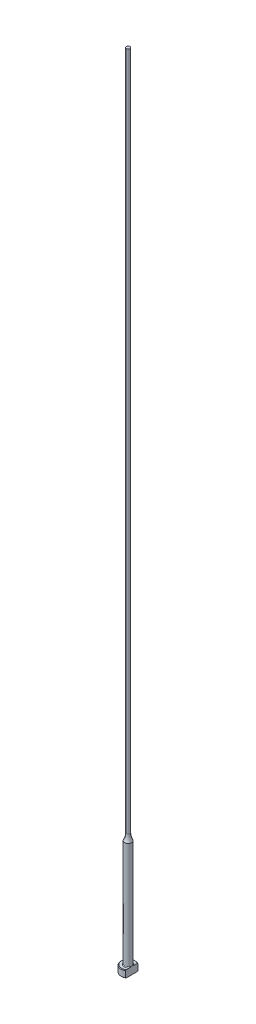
ISO-10303-21;
HEADER;
FILE_DESCRIPTION(('STEP AP214'),'2;1');
FILE_NAME('part.step','',(''),(''),'','','');
FILE_SCHEMA(('AUTOMOTIVE_DESIGN { 1 0 10303 214 1 1 1 1 }'));
ENDSEC;
DATA;
#1=APPLICATION_CONTEXT('core data for automotive mechanical design processes');
#2=APPLICATION_PROTOCOL_DEFINITION('international standard','automotive_design',2000,#1);
#3=PRODUCT_CONTEXT('',#1,'mechanical');
#4=PRODUCT('Part','Part','',(#3));
#5=PRODUCT_RELATED_PRODUCT_CATEGORY('part','',(#4));
#6=PRODUCT_DEFINITION_FORMATION('','',#4);
#7=PRODUCT_DEFINITION_CONTEXT('part definition',#1,'design');
#8=PRODUCT_DEFINITION('design','',#6,#7);
#9=PRODUCT_DEFINITION_SHAPE('','',#8);
#10=(LENGTH_UNIT() NAMED_UNIT(*) SI_UNIT(.MILLI.,.METRE.));
#11=(NAMED_UNIT(*) PLANE_ANGLE_UNIT() SI_UNIT($,.RADIAN.));
#12=(NAMED_UNIT(*) SI_UNIT($,.STERADIAN.) SOLID_ANGLE_UNIT());
#13=UNCERTAINTY_MEASURE_WITH_UNIT(LENGTH_MEASURE(1.E-05),#10,'distance_accuracy_value','');
#14=(GEOMETRIC_REPRESENTATION_CONTEXT(3) GLOBAL_UNCERTAINTY_ASSIGNED_CONTEXT((#13)) GLOBAL_UNIT_ASSIGNED_CONTEXT((#10,
#11,#12)) REPRESENTATION_CONTEXT('',''));
#15=CARTESIAN_POINT('',(0.,0.,0.));
#16=DIRECTION('',(0.,0.,1.));
#17=DIRECTION('',(1.,0.,0.));
#18=AXIS2_PLACEMENT_3D('',#15,#16,#17);
#19=CARTESIAN_POINT('',(-3.17499999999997,3.175,0.));
#20=DIRECTION('',(0.,1.,0.));
#21=DIRECTION('',(0.,0.,1.));
#22=AXIS2_PLACEMENT_3D('',#19,#20,#21);
#23=PLANE('',#22);
#24=CARTESIAN_POINT('',(0.,3.175,0.));
#25=DIRECTION('',(0.,1.,0.));
#26=DIRECTION('',(0.,0.,1.));
#27=AXIS2_PLACEMENT_3D('',#24,#25,#26);
#28=CIRCLE('',#27,2.92099999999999);
#29=CARTESIAN_POINT('',(1.58749999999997,3.175,-2.4519552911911));
#30=VERTEX_POINT('',#29);
#31=CARTESIAN_POINT('',(1.58749999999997,3.175,2.4519552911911));
#32=VERTEX_POINT('',#31);
#33=EDGE_CURVE('E105',#30,#32,#28,.T.);
#34=ORIENTED_EDGE('',*,*,#33,.T.);
#35=DIRECTION('',(0.,0.,1.));
#36=VECTOR('',#35,1.);
#37=CARTESIAN_POINT('',(1.58749999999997,3.17499999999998,2.74963065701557));
#38=LINE('',#37,#36);
#39=CARTESIAN_POINT('',(1.58749999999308,3.175,0.933255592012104));
#40=VERTEX_POINT('',#39);
#41=EDGE_CURVE('E126',#40,#32,#38,.T.);
#42=ORIENTED_EDGE('',*,*,#41,.F.);
#43=CARTESIAN_POINT('',(0.,3.175,0.));
#44=DIRECTION('',(0.,1.,0.));
#45=DIRECTION('',(0.,0.,1.));
#46=AXIS2_PLACEMENT_3D('',#43,#44,#45);
#47=CIRCLE('',#46,1.84149999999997);
#48=CARTESIAN_POINT('',(1.58749999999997,3.17500000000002,-0.933255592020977));
#49=VERTEX_POINT('',#48);
#50=EDGE_CURVE('E11',#40,#49,#47,.F.);
#51=ORIENTED_EDGE('',*,*,#50,.T.);
#52=EDGE_CURVE('E52',#30,#49,#38,.T.);
#53=ORIENTED_EDGE('',*,*,#52,.F.);
#54=EDGE_LOOP('',(#34,#42,#51,#53));
#55=FACE_BOUND('',#54,.T.);
#56=ADVANCED_FACE('F32',(#55),#23,.T.);
#57=CARTESIAN_POINT('',(0.,259.958771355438,0.));
#58=DIRECTION('',(0.,1.,0.));
#59=DIRECTION('',(0.,0.,1.));
#60=AXIS2_PLACEMENT_3D('',#57,#58,#59);
#61=CYLINDRICAL_SURFACE('',#60,3.17499999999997);
#62=CARTESIAN_POINT('',(0.,2.92100000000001,0.));
#63=DIRECTION('',(0.,1.,0.));
#64=DIRECTION('',(0.,0.,1.));
#65=AXIS2_PLACEMENT_3D('',#62,#63,#64);
#66=CIRCLE('',#65,3.17499999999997);
#67=CARTESIAN_POINT('',(1.58749999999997,2.92100000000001,2.74963065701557));
#68=VERTEX_POINT('',#67);
#69=CARTESIAN_POINT('',(1.58749999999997,2.92100000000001,-2.74963065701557));
#70=VERTEX_POINT('',#69);
#71=EDGE_CURVE('E98',#68,#70,#66,.F.);
#72=ORIENTED_EDGE('',*,*,#71,.T.);
#73=DIRECTION('',(0.,-1.,0.));
#74=VECTOR('',#73,1.);
#75=CARTESIAN_POINT('',(1.58749999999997,355.601,-2.74963065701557));
#76=LINE('',#75,#74);
#77=CARTESIAN_POINT('',(1.58749999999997,0.253999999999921,-2.74963065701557));
#78=VERTEX_POINT('',#77);
#79=EDGE_CURVE('E141',#70,#78,#76,.T.);
#80=ORIENTED_EDGE('',*,*,#79,.T.);
#81=CARTESIAN_POINT('',(0.,0.253999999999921,0.));
#82=DIRECTION('',(0.,-1.,0.));
#83=DIRECTION('',(0.,0.,-1.));
#84=AXIS2_PLACEMENT_3D('',#81,#82,#83);
#85=CIRCLE('',#84,3.17499999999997);
#86=CARTESIAN_POINT('',(1.58749999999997,0.253999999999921,2.74963065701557));
#87=VERTEX_POINT('',#86);
#88=EDGE_CURVE('E95',#78,#87,#85,.F.);
#89=ORIENTED_EDGE('',*,*,#88,.T.);
#90=DIRECTION('',(0.,-1.,0.));
#91=VECTOR('',#90,1.);
#92=CARTESIAN_POINT('',(1.58749999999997,355.601,2.74963065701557));
#93=LINE('',#92,#91);
#94=EDGE_CURVE('E88',#68,#87,#93,.T.);
#95=ORIENTED_EDGE('',*,*,#94,.F.);
#96=EDGE_LOOP('',(#72,#80,#89,#95));
#97=FACE_BOUND('',#96,.T.);
#98=ADVANCED_FACE('F191',(#97),#61,.T.);
#99=CARTESIAN_POINT('',(0.,0.,0.));
#100=DIRECTION('',(0.,-1.,0.));
#101=DIRECTION('',(0.,0.,-1.));
#102=AXIS2_PLACEMENT_3D('',#99,#100,#101);
#103=PLANE('',#102);
#104=CARTESIAN_POINT('',(0.,0.,0.));
#105=DIRECTION('',(0.,-1.,0.));
#106=DIRECTION('',(0.,0.,-1.));
#107=AXIS2_PLACEMENT_3D('',#104,#105,#106);
#108=CIRCLE('',#107,2.92100000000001);
#109=CARTESIAN_POINT('',(1.58749999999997,0.,2.45195529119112));
#110=VERTEX_POINT('',#109);
#111=CARTESIAN_POINT('',(1.58749999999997,0.,-2.45195529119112));
#112=VERTEX_POINT('',#111);
#113=EDGE_CURVE('E93',#110,#112,#108,.T.);
#114=ORIENTED_EDGE('',*,*,#113,.T.);
#115=DIRECTION('',(0.,0.,1.));
#116=VECTOR('',#115,1.);
#117=CARTESIAN_POINT('',(1.58749999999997,0.,2.74963065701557));
#118=LINE('',#117,#116);
#119=EDGE_CURVE('E78',#112,#110,#118,.T.);
#120=ORIENTED_EDGE('',*,*,#119,.T.);
#121=EDGE_LOOP('',(#114,#120));
#122=FACE_BOUND('',#121,.T.);
#123=ADVANCED_FACE('F97',(#122),#103,.T.);
#124=CARTESIAN_POINT('',(0.,3.17499999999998,0.));
#125=DIRECTION('',(0.,-1.,0.));
#126=DIRECTION('',(0.,0.,-1.));
#127=AXIS2_PLACEMENT_3D('',#124,#125,#126);
#128=CONICAL_SURFACE('',#127,2.92100000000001,0.785398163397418);
#129=ORIENTED_EDGE('',*,*,#71,.F.);
#130=CARTESIAN_POINT('',(1.58749999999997,-0.161620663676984,-6.0529050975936));
#131=CARTESIAN_POINT('',(1.58749999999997,-0.0288893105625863,-5.91567682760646));
#132=CARTESIAN_POINT('',(1.58749999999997,0.103699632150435,-5.77831035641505));
#133=CARTESIAN_POINT('',(1.58749999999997,0.368508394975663,-5.50321874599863));
#134=CARTESIAN_POINT('',(1.58749999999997,0.5007282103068,-5.3654936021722));
#135=CARTESIAN_POINT('',(1.58749999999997,0.764778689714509,-5.08953516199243));
#136=CARTESIAN_POINT('',(1.58749999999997,0.896609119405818,-4.95130164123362));
#137=CARTESIAN_POINT('',(1.58749999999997,1.15968706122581,-4.67428233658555));
#138=CARTESIAN_POINT('',(1.58749999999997,1.29093457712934,-4.5354965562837));
#139=CARTESIAN_POINT('',(1.58749999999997,1.55007705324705,-4.25997724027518));
#140=CARTESIAN_POINT('',(1.58749999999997,1.67798684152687,-4.12325766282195));
#141=CARTESIAN_POINT('',(1.58749999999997,1.9328486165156,-3.84892898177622));
#142=CARTESIAN_POINT('',(1.58749999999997,2.05980060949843,-3.71131988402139));
#143=CARTESIAN_POINT('',(1.58749999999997,2.31237508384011,-3.43493978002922));
#144=CARTESIAN_POINT('',(1.58749999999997,2.43799784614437,-3.29616903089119));
#145=CARTESIAN_POINT('',(1.58749999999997,2.68741369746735,-3.01699558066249));
#146=CARTESIAN_POINT('',(1.58749999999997,2.81120686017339,-2.8765929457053));
#147=CARTESIAN_POINT('',(1.58749999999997,3.00875865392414,-2.64816703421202));
#148=CARTESIAN_POINT('',(1.58749999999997,3.08336151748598,-2.56087478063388));
#149=CARTESIAN_POINT('',(1.58749999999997,3.23123871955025,-2.385154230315));
#150=CARTESIAN_POINT('',(1.58749999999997,3.30451292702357,-2.29672582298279));
#151=CARTESIAN_POINT('',(1.58749999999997,3.45004422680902,-2.11747400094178));
#152=CARTESIAN_POINT('',(1.58749999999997,3.52228237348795,-2.02663514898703));
#153=CARTESIAN_POINT('',(1.58749999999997,3.66423097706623,-1.84302524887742));
#154=CARTESIAN_POINT('',(1.58749999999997,3.73394203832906,-1.75025467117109));
#155=CARTESIAN_POINT('',(1.58749999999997,3.87080633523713,-1.56067475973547));
#156=CARTESIAN_POINT('',(1.58749999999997,3.93790459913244,-1.46382547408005));
#157=CARTESIAN_POINT('',(1.58749999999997,4.06669147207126,-1.26632594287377));
#158=CARTESIAN_POINT('',(1.58749999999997,4.12837264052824,-1.16567073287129));
#159=CARTESIAN_POINT('',(1.58749999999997,4.21402252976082,-1.01165766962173));
#160=CARTESIAN_POINT('',(1.58749999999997,4.2412792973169,-0.960142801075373));
#161=CARTESIAN_POINT('',(1.58749999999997,4.29309798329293,-0.85578092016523));
#162=CARTESIAN_POINT('',(1.58749999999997,4.3176594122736,-0.802933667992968));
#163=CARTESIAN_POINT('',(1.58749999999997,4.38614656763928,-0.642461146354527));
#164=CARTESIAN_POINT('',(1.58749999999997,4.42510149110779,-0.532518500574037));
#165=CARTESIAN_POINT('',(1.58749999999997,4.46726244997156,-0.367680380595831));
#166=CARTESIAN_POINT('',(1.58749999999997,4.47844427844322,-0.314802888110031));
#167=CARTESIAN_POINT('',(1.58749999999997,4.49576654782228,-0.208209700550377));
#168=CARTESIAN_POINT('',(1.58749999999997,4.50190743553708,-0.154494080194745));
#169=CARTESIAN_POINT('',(1.58749999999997,4.50871296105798,-0.0468792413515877));
#170=CARTESIAN_POINT('',(1.58749999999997,4.50939451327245,0.00701889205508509));
#171=CARTESIAN_POINT('',(1.58749999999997,4.5052767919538,0.114606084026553));
#172=CARTESIAN_POINT('',(1.58749999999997,4.5004770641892,0.16829512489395));
#173=CARTESIAN_POINT('',(1.58749999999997,4.48579689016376,0.274485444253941));
#174=CARTESIAN_POINT('',(1.58749999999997,4.47596081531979,0.326992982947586));
#175=CARTESIAN_POINT('',(1.58749999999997,4.4518180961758,0.430974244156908));
#176=CARTESIAN_POINT('',(1.58749999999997,4.43750969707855,0.482447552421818));
#177=CARTESIAN_POINT('',(1.58749999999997,4.40502489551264,0.58446088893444));
#178=CARTESIAN_POINT('',(1.58749999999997,4.38682724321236,0.634994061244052));
#179=CARTESIAN_POINT('',(1.58749999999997,4.34729308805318,0.734789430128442));
#180=CARTESIAN_POINT('',(1.58749999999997,4.32595722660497,0.784051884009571));
#181=CARTESIAN_POINT('',(1.58749999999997,4.25791922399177,0.93054934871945));
#182=CARTESIAN_POINT('',(1.58749999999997,4.20736047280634,1.02598802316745));
#183=CARTESIAN_POINT('',(1.58749999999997,4.09955451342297,1.21304313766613));
#184=CARTESIAN_POINT('',(1.58749999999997,4.04229912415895,1.30465471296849));
#185=CARTESIAN_POINT('',(1.58749999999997,3.92308746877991,1.48526211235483));
#186=CARTESIAN_POINT('',(1.58749999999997,3.86111349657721,1.57424615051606));
#187=CARTESIAN_POINT('',(1.58749999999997,3.73408621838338,1.74990003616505));
#188=CARTESIAN_POINT('',(1.58749999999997,3.66903444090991,1.83657099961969));
#189=CARTESIAN_POINT('',(1.58749999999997,3.53583371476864,2.009317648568));
#190=CARTESIAN_POINT('',(1.58749999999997,3.46765527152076,2.09537048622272));
#191=CARTESIAN_POINT('',(1.58749999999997,3.32960643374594,2.26611736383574));
#192=CARTESIAN_POINT('',(1.58749999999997,3.25973586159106,2.35081125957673));
#193=CARTESIAN_POINT('',(1.58749999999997,3.04858139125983,2.60290121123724));
#194=CARTESIAN_POINT('',(1.58749999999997,2.90542388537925,2.7687253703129));
#195=CARTESIAN_POINT('',(1.58749999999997,2.64069522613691,3.06970913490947));
#196=CARTESIAN_POINT('',(1.58749999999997,2.5195945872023,3.20528660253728));
#197=CARTESIAN_POINT('',(1.58749999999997,2.27590400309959,3.47510321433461));
#198=CARTESIAN_POINT('',(1.58749999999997,2.1533140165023,3.60934232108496));
#199=CARTESIAN_POINT('',(1.58749999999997,1.9069423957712,3.87695374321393));
#200=CARTESIAN_POINT('',(1.58749999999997,1.78315974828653,4.01032512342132));
#201=CARTESIAN_POINT('',(1.58749999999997,1.53478104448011,4.2763088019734));
#202=CARTESIAN_POINT('',(1.58749999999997,1.41018498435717,4.40892109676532));
#203=CARTESIAN_POINT('',(1.58749999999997,1.04574684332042,4.79499418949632));
#204=CARTESIAN_POINT('',(1.58749999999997,0.805076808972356,5.04767313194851));
#205=CARTESIAN_POINT('',(1.58749999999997,0.44312150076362,5.42550911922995));
#206=CARTESIAN_POINT('',(1.58749999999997,0.322378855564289,5.55118772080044));
#207=CARTESIAN_POINT('',(1.58749999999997,0.0805914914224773,5.8022520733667));
#208=CARTESIAN_POINT('',(1.58749999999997,-0.0404532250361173,5.92763782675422));
#209=CARTESIAN_POINT('',(1.58749999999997,-0.161620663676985,6.0529050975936));
#210=B_SPLINE_CURVE_WITH_KNOTS('',3,(#130,#131,#132,#133,#134,#135,#136,#137,#138,#139,#140,
#141,#142,#143,#144,#145,#146,#147,#148,#149,#150,#151,#152,#153,#154,#155,#156,#157,#158,#159,
#160,#161,#162,#163,#164,#165,#166,#167,#168,#169,#170,#171,#172,#173,#174,#175,#176,#177,#178,
#179,#180,#181,#182,#183,#184,#185,#186,#187,#188,#189,#190,#191,#192,#193,#194,#195,#196,#197,
#198,#199,#200,#201,#202,#203,#204,#205,#206,#207,#208,#209),.UNSPECIFIED.,.F.,.F.,(4,2,2,2,2,2,
2,2,2,2,2,2,2,2,2,2,2,2,2,2,2,2,2,2,2,2,2,2,2,2,2,2,2,2,2,2,2,2,2,4),(0.,0.572750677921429,
1.14550874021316,1.71856057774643,2.29160869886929,2.85328006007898,3.41494773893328,
3.97649423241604,4.53801804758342,4.88249307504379,5.2270018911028,5.57515326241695,
5.92322081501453,6.27657800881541,6.63041319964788,6.80518126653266,6.97998101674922,
7.32824262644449,7.49018491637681,7.65211285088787,7.81353889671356,7.97497832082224,
8.13501929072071,8.29512313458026,8.45612518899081,8.61709438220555,8.94062993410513,
9.26456495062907,9.58978187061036,9.91483894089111,10.2441741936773,10.5735441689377,
11.2306812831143,11.7760337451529,12.3214014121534,12.8672825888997,13.4131663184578,
14.4600164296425,14.9828595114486,15.505698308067),.UNSPECIFIED.);
#211=EDGE_CURVE('E118',#32,#68,#210,.T.);
#212=ORIENTED_EDGE('',*,*,#211,.F.);
#213=ORIENTED_EDGE('',*,*,#33,.F.);
#214=EDGE_CURVE('E117',#70,#30,#210,.T.);
#215=ORIENTED_EDGE('',*,*,#214,.F.);
#216=EDGE_LOOP('',(#129,#212,#213,#215));
#217=FACE_BOUND('',#216,.T.);
#218=ADVANCED_FACE('F162',(#217),#128,.T.);
#219=CARTESIAN_POINT('',(0.,0.253999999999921,0.));
#220=DIRECTION('',(0.,1.,0.));
#221=DIRECTION('',(0.,0.,1.));
#222=AXIS2_PLACEMENT_3D('',#219,#220,#221);
#223=CONICAL_SURFACE('',#222,3.17499999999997,0.785398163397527);
#224=ORIENTED_EDGE('',*,*,#88,.F.);
#225=CARTESIAN_POINT('',(1.58749999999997,3.33662066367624,6.0529050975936));
#226=CARTESIAN_POINT('',(1.58749999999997,3.20388931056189,5.91567682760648));
#227=CARTESIAN_POINT('',(1.58749999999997,3.07130036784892,5.7783103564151));
#228=CARTESIAN_POINT('',(1.58749999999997,2.80649160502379,5.50321874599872));
#229=CARTESIAN_POINT('',(1.58749999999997,2.6742717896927,5.36549360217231));
#230=CARTESIAN_POINT('',(1.58749999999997,2.41022131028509,5.08953516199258));
#231=CARTESIAN_POINT('',(1.58749999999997,2.27839088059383,4.95130164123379));
#232=CARTESIAN_POINT('',(1.58749999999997,2.01531293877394,4.67428233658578));
#233=CARTESIAN_POINT('',(1.58749999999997,1.88406542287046,4.53549655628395));
#234=CARTESIAN_POINT('',(1.58749999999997,1.62492294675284,4.25997724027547));
#235=CARTESIAN_POINT('',(1.58749999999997,1.49701315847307,4.12325766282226));
#236=CARTESIAN_POINT('',(1.58749999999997,1.24215138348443,3.84892898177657));
#237=CARTESIAN_POINT('',(1.58749999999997,1.11519939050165,3.71131988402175));
#238=CARTESIAN_POINT('',(1.58749999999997,0.862624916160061,3.43493978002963));
#239=CARTESIAN_POINT('',(1.58749999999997,0.737002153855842,3.29616903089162));
#240=CARTESIAN_POINT('',(1.58749999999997,0.487586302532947,3.01699558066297));
#241=CARTESIAN_POINT('',(1.58749999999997,0.363793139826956,2.8765929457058));
#242=CARTESIAN_POINT('',(1.58749999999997,0.166241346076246,2.64816703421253));
#243=CARTESIAN_POINT('',(1.58749999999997,0.0916384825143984,2.56087478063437));
#244=CARTESIAN_POINT('',(1.58749999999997,-0.0562387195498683,2.38515423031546));
#245=CARTESIAN_POINT('',(1.58749999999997,-0.129512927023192,2.29672582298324));
#246=CARTESIAN_POINT('',(1.58749999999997,-0.275044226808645,2.1174740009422));
#247=CARTESIAN_POINT('',(1.58749999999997,-0.347282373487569,2.02663514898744));
#248=CARTESIAN_POINT('',(1.58749999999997,-0.489230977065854,1.8430252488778));
#249=CARTESIAN_POINT('',(1.58749999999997,-0.558942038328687,1.75025467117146));
#250=CARTESIAN_POINT('',(1.58749999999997,-0.695806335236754,1.5606747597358));
#251=CARTESIAN_POINT('',(1.58749999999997,-0.762904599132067,1.46382547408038));
#252=CARTESIAN_POINT('',(1.58749999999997,-0.89169147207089,1.26632594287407));
#253=CARTESIAN_POINT('',(1.58749999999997,-0.953372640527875,1.16567073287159));
#254=CARTESIAN_POINT('',(1.58749999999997,-1.03902252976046,1.01165766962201));
#255=CARTESIAN_POINT('',(1.58749999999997,-1.06627929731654,0.960142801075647));
#256=CARTESIAN_POINT('',(1.58749999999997,-1.11809798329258,0.855780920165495));
#257=CARTESIAN_POINT('',(1.58749999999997,-1.14265941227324,0.802933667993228));
#258=CARTESIAN_POINT('',(1.58749999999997,-1.21114656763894,0.642461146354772));
#259=CARTESIAN_POINT('',(1.58749999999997,-1.25010149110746,0.532518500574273));
#260=CARTESIAN_POINT('',(1.58749999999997,-1.29226244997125,0.367680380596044));
#261=CARTESIAN_POINT('',(1.58749999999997,-1.30344427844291,0.314802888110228));
#262=CARTESIAN_POINT('',(1.58749999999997,-1.32076654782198,0.208209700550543));
#263=CARTESIAN_POINT('',(1.58749999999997,-1.32690743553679,0.154494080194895));
#264=CARTESIAN_POINT('',(1.58749999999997,-1.3337129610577,0.0468792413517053));
#265=CARTESIAN_POINT('',(1.58749999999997,-1.33439451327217,-0.00701889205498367));
#266=CARTESIAN_POINT('',(1.58749999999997,-1.33027679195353,-0.114606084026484));
#267=CARTESIAN_POINT('',(1.58749999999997,-1.32547706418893,-0.168295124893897));
#268=CARTESIAN_POINT('',(1.58749999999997,-1.31079689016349,-0.274485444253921));
#269=CARTESIAN_POINT('',(1.58749999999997,-1.30096081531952,-0.326992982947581));
#270=CARTESIAN_POINT('',(1.58749999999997,-1.27681809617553,-0.430974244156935));
#271=CARTESIAN_POINT('',(1.58749999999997,-1.26250969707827,-0.48244755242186));
#272=CARTESIAN_POINT('',(1.58749999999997,-1.23002489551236,-0.584460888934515));
#273=CARTESIAN_POINT('',(1.58749999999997,-1.21182724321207,-0.634994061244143));
#274=CARTESIAN_POINT('',(1.58749999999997,-1.17229308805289,-0.734789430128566));
#275=CARTESIAN_POINT('',(1.58749999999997,-1.15095722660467,-0.784051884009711));
#276=CARTESIAN_POINT('',(1.58749999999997,-1.08291922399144,-0.930549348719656));
#277=CARTESIAN_POINT('',(1.58749999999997,-1.03236047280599,-1.0259880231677));
#278=CARTESIAN_POINT('',(1.58749999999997,-0.924554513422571,-1.21304313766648));
#279=CARTESIAN_POINT('',(1.58749999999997,-0.867299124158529,-1.30465471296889));
#280=CARTESIAN_POINT('',(1.58749999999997,-0.748087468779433,-1.48526211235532));
#281=CARTESIAN_POINT('',(1.58749999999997,-0.686113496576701,-1.5742461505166));
#282=CARTESIAN_POINT('',(1.58749999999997,-0.559086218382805,-1.74990003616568));
#283=CARTESIAN_POINT('',(1.58749999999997,-0.494034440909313,-1.83657099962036));
#284=CARTESIAN_POINT('',(1.58749999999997,-0.360833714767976,-2.00931764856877));
#285=CARTESIAN_POINT('',(1.58749999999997,-0.292655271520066,-2.09537048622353));
#286=CARTESIAN_POINT('',(1.58749999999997,-0.154606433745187,-2.26611736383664));
#287=CARTESIAN_POINT('',(1.58749999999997,-0.0847358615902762,-2.35081125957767));
#288=CARTESIAN_POINT('',(1.58749999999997,0.126418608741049,-2.60290121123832));
#289=CARTESIAN_POINT('',(1.58749999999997,0.269576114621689,-2.76872537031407));
#290=CARTESIAN_POINT('',(1.58749999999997,0.534304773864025,-3.06970913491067));
#291=CARTESIAN_POINT('',(1.58749999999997,0.655405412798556,-3.20528660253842));
#292=CARTESIAN_POINT('',(1.58749999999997,0.899095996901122,-3.47510321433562));
#293=CARTESIAN_POINT('',(1.58749999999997,1.02168598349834,-3.60934232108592));
#294=CARTESIAN_POINT('',(1.58749999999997,1.26805760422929,-3.87695374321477));
#295=CARTESIAN_POINT('',(1.58749999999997,1.39184025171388,-4.0103251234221));
#296=CARTESIAN_POINT('',(1.58749999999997,1.64021895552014,-4.27630880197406));
#297=CARTESIAN_POINT('',(1.58749999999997,1.76481501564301,-4.40892109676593));
#298=CARTESIAN_POINT('',(1.58749999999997,2.12925315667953,-4.79499418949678));
#299=CARTESIAN_POINT('',(1.58749999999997,2.36992319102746,-5.04767313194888));
#300=CARTESIAN_POINT('',(1.58749999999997,2.73187849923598,-5.42550911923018));
#301=CARTESIAN_POINT('',(1.58749999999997,2.85262114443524,-5.55118772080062));
#302=CARTESIAN_POINT('',(1.58749999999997,3.09440850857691,-5.80225207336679));
#303=CARTESIAN_POINT('',(1.58749999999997,3.21545322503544,-5.92763782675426));
#304=CARTESIAN_POINT('',(1.58749999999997,3.33662066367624,-6.0529050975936));
#305=B_SPLINE_CURVE_WITH_KNOTS('',3,(#225,#226,#227,#228,#229,#230,#231,#232,#233,#234,#235,
#236,#237,#238,#239,#240,#241,#242,#243,#244,#245,#246,#247,#248,#249,#250,#251,#252,#253,#254,
#255,#256,#257,#258,#259,#260,#261,#262,#263,#264,#265,#266,#267,#268,#269,#270,#271,#272,#273,
#274,#275,#276,#277,#278,#279,#280,#281,#282,#283,#284,#285,#286,#287,#288,#289,#290,#291,#292,
#293,#294,#295,#296,#297,#298,#299,#300,#301,#302,#303,#304),.UNSPECIFIED.,.F.,.F.,(4,2,2,2,2,2,
2,2,2,2,2,2,2,2,2,2,2,2,2,2,2,2,2,2,2,2,2,2,2,2,2,2,2,2,2,2,2,2,2,4),(0.,0.572750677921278,
1.14550874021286,1.71856057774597,2.29160869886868,2.85328006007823,3.4149477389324,
3.97649423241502,4.53801804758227,4.88249307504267,5.22700189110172,5.5751532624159,
5.92322081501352,6.27657800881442,6.63041319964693,6.80518126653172,6.9799810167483,
7.3282426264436,7.49018491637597,7.65211285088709,7.81353889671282,7.97497832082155,
8.13501929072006,8.29512313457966,8.45612518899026,8.61709438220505,8.9406299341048,
9.2645649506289,9.58978187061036,9.91483894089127,10.2441741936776,10.5735441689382,
11.2306812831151,11.7760337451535,12.3214014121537,12.8672825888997,13.4131663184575,
14.4600164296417,14.9828595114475,15.5056983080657),.UNSPECIFIED.);
#306=EDGE_CURVE('E81',#112,#78,#305,.T.);
#307=ORIENTED_EDGE('',*,*,#306,.F.);
#308=ORIENTED_EDGE('',*,*,#113,.F.);
#309=EDGE_CURVE('E84',#87,#110,#305,.T.);
#310=ORIENTED_EDGE('',*,*,#309,.F.);
#311=EDGE_LOOP('',(#224,#307,#308,#310));
#312=FACE_BOUND('',#311,.T.);
#313=ADVANCED_FACE('F92',(#312),#223,.T.);
#314=CARTESIAN_POINT('',(0.,3.42900000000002,0.));
#315=DIRECTION('',(0.,1.,0.));
#316=DIRECTION('',(0.,0.,1.));
#317=AXIS2_PLACEMENT_3D('',#314,#315,#316);
#318=TOROIDAL_SURFACE('',#317,1.84149999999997,0.254);
#319=CARTESIAN_POINT('',(1.58749999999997,3.42900000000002,0.));
#320=CARTESIAN_POINT('',(1.58749999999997,3.42899942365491,-1.9220514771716E-10));
#321=CARTESIAN_POINT('',(1.58749999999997,3.42899884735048,-1.2261161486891E-07));
#322=CARTESIAN_POINT('',(1.58749999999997,3.42899773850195,-5.09676365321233E-07));
#323=CARTESIAN_POINT('',(1.58749999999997,3.42899720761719,-7.78176328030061E-07));
#324=CARTESIAN_POINT('',(1.58749999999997,3.42899614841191,-1.42307272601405E-06));
#325=CARTESIAN_POINT('',(1.58749999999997,3.42899562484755,-1.80713867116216E-06));
#326=CARTESIAN_POINT('',(1.58749999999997,3.42899463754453,-2.63494846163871E-06));
#327=CARTESIAN_POINT('',(1.58749999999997,3.42899417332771,-3.07814756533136E-06));
#328=CARTESIAN_POINT('',(1.58749999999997,3.42899261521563,-4.66897357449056E-06));
#329=CARTESIAN_POINT('',(1.58749999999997,3.42899159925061,-5.89404908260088E-06));
#330=CARTESIAN_POINT('',(1.58749999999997,3.42898979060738,-8.42427511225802E-06));
#331=CARTESIAN_POINT('',(1.58749999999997,3.42898899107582,-9.7248057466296E-06));
#332=CARTESIAN_POINT('',(1.58749999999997,3.42898598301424,-1.48060601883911E-05));
#333=CARTESIAN_POINT('',(1.58749999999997,3.42898393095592,-1.86838281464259E-05));
#334=CARTESIAN_POINT('',(1.58749999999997,3.42898057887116,-2.63261117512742E-05));
#335=CARTESIAN_POINT('',(1.58749999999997,3.42897922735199,-3.00687417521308E-05));
#336=CARTESIAN_POINT('',(1.58749999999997,3.42897347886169,-4.60276298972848E-05));
#337=CARTESIAN_POINT('',(1.58749999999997,3.42896911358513,-5.8247019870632E-05));
#338=CARTESIAN_POINT('',(1.58749999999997,3.42896211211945,-8.11070097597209E-05));
#339=CARTESIAN_POINT('',(1.58749999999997,3.42895931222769,-9.16953114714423E-05));
#340=CARTESIAN_POINT('',(1.58749999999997,3.42893712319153,-0.000168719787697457));
#341=CARTESIAN_POINT('',(1.58749999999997,3.42890881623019,-0.000232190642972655));
#342=CARTESIAN_POINT('',(1.58749999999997,3.42880276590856,-0.000479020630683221));
#343=CARTESIAN_POINT('',(1.58749999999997,3.42873165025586,-0.00066443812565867));
#344=CARTESIAN_POINT('',(1.58749999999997,3.42845137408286,-0.0013844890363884));
#345=CARTESIAN_POINT('',(1.58749999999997,3.42823526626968,-0.00191701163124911));
#346=CARTESIAN_POINT('',(1.58749999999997,3.42735449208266,-0.00409774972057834));
#347=CARTESIAN_POINT('',(1.58749999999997,3.42669768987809,-0.00574830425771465));
#348=CARTESIAN_POINT('',(1.58749999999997,3.4174405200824,-0.0289985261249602));
#349=CARTESIAN_POINT('',(1.58749999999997,3.40878325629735,-0.0505816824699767));
#350=CARTESIAN_POINT('',(1.58749999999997,3.39189297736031,-0.0929947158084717));
#351=CARTESIAN_POINT('',(1.58749999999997,3.38365605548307,-0.11382315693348));
#352=CARTESIAN_POINT('',(1.58749999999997,3.36635393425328,-0.157956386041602));
#353=CARTESIAN_POINT('',(1.58749999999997,3.35730391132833,-0.181267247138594));
#354=CARTESIAN_POINT('',(1.58749999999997,3.33936775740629,-0.228222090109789));
#355=CARTESIAN_POINT('',(1.58749999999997,3.33048420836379,-0.25186705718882));
#356=CARTESIAN_POINT('',(1.58749999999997,3.30894496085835,-0.310512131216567));
#357=CARTESIAN_POINT('',(1.58749999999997,3.29649449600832,-0.345588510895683));
#358=CARTESIAN_POINT('',(1.58749999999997,3.27296975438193,-0.415278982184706));
#359=CARTESIAN_POINT('',(1.58749999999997,3.26186987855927,-0.449884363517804));
#360=CARTESIAN_POINT('',(1.58749999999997,3.2395832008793,-0.524471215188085));
#361=CARTESIAN_POINT('',(1.58749999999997,3.22860862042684,-0.564517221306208));
#362=CARTESIAN_POINT('',(1.58749999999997,3.20902534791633,-0.645529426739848));
#363=CARTESIAN_POINT('',(1.58749999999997,3.20043582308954,-0.686500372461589));
#364=CARTESIAN_POINT('',(1.58749999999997,3.18611712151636,-0.771546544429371));
#365=CARTESIAN_POINT('',(1.58749999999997,3.18059550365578,-0.815658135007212));
#366=CARTESIAN_POINT('',(1.58749999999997,3.17455396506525,-0.904117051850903));
#367=CARTESIAN_POINT('',(1.58749999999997,3.17401361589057,-0.948462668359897));
#368=CARTESIAN_POINT('',(1.58749999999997,3.17898948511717,-1.02531896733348));
#369=CARTESIAN_POINT('',(1.58749999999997,3.1829739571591,-1.05792141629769));
#370=CARTESIAN_POINT('',(1.58749999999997,3.19569167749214,-1.12184393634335));
#371=CARTESIAN_POINT('',(1.58749999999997,3.20436049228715,-1.1531753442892));
#372=CARTESIAN_POINT('',(1.58749999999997,3.22236152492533,-1.19946468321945));
#373=CARTESIAN_POINT('',(1.58749999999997,3.2295150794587,-1.21526783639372));
#374=CARTESIAN_POINT('',(1.58749999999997,3.24587062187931,-1.24583726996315));
#375=CARTESIAN_POINT('',(1.58749999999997,3.25507530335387,-1.26060215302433));
#376=CARTESIAN_POINT('',(1.58749999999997,3.27378481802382,-1.28575815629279));
#377=CARTESIAN_POINT('',(1.58749999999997,3.28289001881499,-1.29644383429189));
#378=CARTESIAN_POINT('',(1.58749999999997,3.30268460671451,-1.31623154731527));
#379=CARTESIAN_POINT('',(1.58749999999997,3.31337067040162,-1.32533681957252));
#380=CARTESIAN_POINT('',(1.58749999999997,3.33349977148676,-1.33941140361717));
#381=CARTESIAN_POINT('',(1.58749999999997,3.34261446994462,-1.34484814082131));
#382=CARTESIAN_POINT('',(1.58749999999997,3.36161455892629,-1.35416329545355));
#383=CARTESIAN_POINT('',(1.58749999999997,3.37149946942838,-1.35804267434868));
#384=CARTESIAN_POINT('',(1.58749999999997,3.39188678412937,-1.36398436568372));
#385=CARTESIAN_POINT('',(1.58749999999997,3.40239309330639,-1.36603350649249));
#386=CARTESIAN_POINT('',(1.58749999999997,3.42360372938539,-1.3680840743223));
#387=CARTESIAN_POINT('',(1.58749999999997,3.43430795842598,-1.36808648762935));
#388=CARTESIAN_POINT('',(1.58749999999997,3.45433283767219,-1.36616208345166));
#389=CARTESIAN_POINT('',(1.58749999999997,3.46367506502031,-1.36444960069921));
#390=CARTESIAN_POINT('',(1.58749999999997,3.48195519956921,-1.35953338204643));
#391=CARTESIAN_POINT('',(1.58749999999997,3.49089304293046,-1.3563294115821));
#392=CARTESIAN_POINT('',(1.58749999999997,3.50850302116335,-1.34848006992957));
#393=CARTESIAN_POINT('',(1.58749999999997,3.5171531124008,-1.34378578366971));
#394=CARTESIAN_POINT('',(1.58749999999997,3.53371257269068,-1.33324445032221));
#395=CARTESIAN_POINT('',(1.58749999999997,3.54162163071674,-1.32739692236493));
#396=CARTESIAN_POINT('',(1.58749999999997,3.56107121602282,-1.31107304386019));
#397=CARTESIAN_POINT('',(1.58749999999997,3.57202221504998,-1.29989286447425));
#398=CARTESIAN_POINT('',(1.58749999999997,3.59202509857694,-1.27593566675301));
#399=CARTESIAN_POINT('',(1.58749999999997,3.60107086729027,-1.26315370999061));
#400=CARTESIAN_POINT('',(1.58749999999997,3.62186023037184,-1.22930733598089));
#401=CARTESIAN_POINT('',(1.58749999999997,3.63240584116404,-1.20751096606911));
#402=CARTESIAN_POINT('',(1.58749999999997,3.65004643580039,-1.16266144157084));
#403=CARTESIAN_POINT('',(1.58749999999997,3.65714435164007,-1.13960937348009));
#404=CARTESIAN_POINT('',(1.58749999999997,3.67265428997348,-1.07603916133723));
#405=CARTESIAN_POINT('',(1.58749999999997,3.67834921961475,-1.03486686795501));
#406=CARTESIAN_POINT('',(1.58749999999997,3.68382880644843,-0.951558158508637));
#407=CARTESIAN_POINT('',(1.58749999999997,3.68350976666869,-0.909417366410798));
#408=CARTESIAN_POINT('',(1.58749999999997,3.67745397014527,-0.811383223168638));
#409=CARTESIAN_POINT('',(1.58749999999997,3.66993873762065,-0.755610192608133));
#410=CARTESIAN_POINT('',(1.58749999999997,3.64933373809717,-0.644937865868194));
#411=CARTESIAN_POINT('',(1.58749999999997,3.63621897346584,-0.59004364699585));
#412=CARTESIAN_POINT('',(1.58749999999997,3.60740922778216,-0.485757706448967));
#413=CARTESIAN_POINT('',(1.58749999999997,3.59201096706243,-0.436281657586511));
#414=CARTESIAN_POINT('',(1.58749999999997,3.55922497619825,-0.338551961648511));
#415=CARTESIAN_POINT('',(1.58749999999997,3.5418584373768,-0.290291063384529));
#416=CARTESIAN_POINT('',(1.58749999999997,3.51760237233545,-0.225557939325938));
#417=CARTESIAN_POINT('',(1.58749999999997,3.51126413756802,-0.208874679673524));
#418=CARTESIAN_POINT('',(1.58749999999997,3.49830042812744,-0.17512392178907));
#419=CARTESIAN_POINT('',(1.58749999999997,3.49167176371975,-0.158057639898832));
#420=CARTESIAN_POINT('',(1.58749999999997,3.47585523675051,-0.117638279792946));
#421=CARTESIAN_POINT('',(1.58749999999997,3.46662970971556,-0.0943002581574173));
#422=CARTESIAN_POINT('',(1.58749999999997,3.44889695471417,-0.0497824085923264));
#423=CARTESIAN_POINT('',(1.58749999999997,3.44040039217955,-0.028598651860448));
#424=CARTESIAN_POINT('',(1.58749999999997,3.43130364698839,-0.00575168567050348));
#425=CARTESIAN_POINT('',(1.58749999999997,3.43064818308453,-0.00410451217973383));
#426=CARTESIAN_POINT('',(1.58749999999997,3.42976776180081,-0.00192459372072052));
#427=CARTESIAN_POINT('',(1.58749999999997,3.42955062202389,-0.00138952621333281));
#428=CARTESIAN_POINT('',(1.58749999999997,3.42926908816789,-0.000666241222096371));
#429=CARTESIAN_POINT('',(1.58749999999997,3.42919771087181,-0.000480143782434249));
#430=CARTESIAN_POINT('',(1.58749999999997,3.42909131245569,-0.000232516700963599));
#431=CARTESIAN_POINT('',(1.58749999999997,3.42906294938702,-0.000168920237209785));
#432=CARTESIAN_POINT('',(1.58749999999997,3.42904072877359,-9.17527162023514E-05));
#433=CARTESIAN_POINT('',(1.58749999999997,3.42903792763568,-8.11550293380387E-05));
#434=CARTESIAN_POINT('',(1.58749999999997,3.42903091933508,-5.82743948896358E-05));
#435=CARTESIAN_POINT('',(1.58749999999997,3.42902654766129,-4.60440001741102E-05));
#436=CARTESIAN_POINT('',(1.58749999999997,3.42902079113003,-3.00727682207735E-05));
#437=CARTESIAN_POINT('',(1.58749999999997,3.42901943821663,-2.63286807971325E-05));
#438=CARTESIAN_POINT('',(1.58749999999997,3.42901608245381,-1.86836529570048E-05));
#439=CARTESIAN_POINT('',(1.58749999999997,3.4290140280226,-1.48046517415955E-05));
#440=CARTESIAN_POINT('',(1.58749999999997,3.42901101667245,-9.72223943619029E-06));
#441=CARTESIAN_POINT('',(1.58749999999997,3.42901021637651,-8.42159649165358E-06));
#442=CARTESIAN_POINT('',(1.58749999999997,3.42900840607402,-5.89129729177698E-06));
#443=CARTESIAN_POINT('',(1.58749999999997,3.42900738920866,-4.66626867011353E-06));
#444=CARTESIAN_POINT('',(1.58749999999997,3.42900582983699,-3.07568803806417E-06));
#445=CARTESIAN_POINT('',(1.58749999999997,3.42900536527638,-2.63259565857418E-06));
#446=CARTESIAN_POINT('',(1.58749999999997,3.4290043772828,-1.80506085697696E-06));
#447=CARTESIAN_POINT('',(1.58749999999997,3.42900385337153,-1.42116387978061E-06));
#448=CARTESIAN_POINT('',(1.58749999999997,3.42900279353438,-7.76675643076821E-07));
#449=CARTESIAN_POINT('',(1.58749999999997,3.42900226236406,-5.08406487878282E-07));
#450=CARTESIAN_POINT('',(1.58749999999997,3.42900115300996,-1.21901887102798E-07));
#451=CARTESIAN_POINT('',(1.58749999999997,3.42900057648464,1.92251677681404E-10));
#452=CARTESIAN_POINT('',(1.58749999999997,3.42900000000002,0.));
#453=B_SPLINE_CURVE_WITH_KNOTS('',3,(#319,#320,#321,#322,#323,#324,#325,#326,#327,#328,#329,
#330,#331,#332,#333,#334,#335,#336,#337,#338,#339,#340,#341,#342,#343,#344,#345,#346,#347,#348,
#349,#350,#351,#352,#353,#354,#355,#356,#357,#358,#359,#360,#361,#362,#363,#364,#365,#366,#367,
#368,#369,#370,#371,#372,#373,#374,#375,#376,#377,#378,#379,#380,#381,#382,#383,#384,#385,#386,
#387,#388,#389,#390,#391,#392,#393,#394,#395,#396,#397,#398,#399,#400,#401,#402,#403,#404,#405,
#406,#407,#408,#409,#410,#411,#412,#413,#414,#415,#416,#417,#418,#419,#420,#421,#422,#423,#424,
#425,#426,#427,#428,#429,#430,#431,#432,#433,#434,#435,#436,#437,#438,#439,#440,#441,#442,#443,
#444,#445,#446,#447,#448,#449,#450,#451,#452),.UNSPECIFIED.,.T.,.F.,(4,2,2,2,2,2,2,2,2,2,2,2,2,
2,2,2,2,2,2,2,2,2,2,2,2,2,2,2,2,2,2,2,2,2,2,2,2,2,2,2,2,2,2,2,2,2,2,2,2,2,2,2,2,2,2,2,2,2,2,2,2,
2,2,2,2,2,4),(0.,1.72815458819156E-06,3.50429255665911E-06,5.44431004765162E-06,
7.3675525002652E-06,1.2119089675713E-05,1.66953775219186E-05,2.98160400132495E-05,
4.17409564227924E-05,8.0660475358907E-05,0.000113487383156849,0.000321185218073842,
0.000917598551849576,0.00264089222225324,0.00797105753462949,0.0777276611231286,
0.144923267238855,0.219939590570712,0.295714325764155,0.407362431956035,0.516367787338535,
0.640878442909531,0.766362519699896,0.899536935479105,1.03216495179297,1.13045740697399,
1.22743103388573,1.27935899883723,1.33135556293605,1.37333248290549,1.41522237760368,
1.44693946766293,1.47863694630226,1.51056074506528,1.54246916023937,1.57083210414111,
1.59919951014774,1.62861579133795,1.65804436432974,1.70472658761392,1.75155645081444,
1.82378709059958,1.89595619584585,2.01995471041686,2.1460932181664,2.31447224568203,
2.48361094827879,2.6389891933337,2.79283011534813,2.84637031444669,2.9012946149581,
2.97658236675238,3.04504771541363,3.05036697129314,3.05209849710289,3.05269709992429,
3.05290520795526,3.05293806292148,3.05297701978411,3.05298895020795,3.05300207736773,
3.05300665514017,3.0530114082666,3.05301333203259,3.05301527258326,3.05301704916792,
3.05301877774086),.UNSPECIFIED.);
#454=CARTESIAN_POINT('',(1.58749999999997,3.42900000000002,0.));
#455=VERTEX_POINT('',#454);
#456=EDGE_CURVE('E47',#455,#49,#453,.T.);
#457=ORIENTED_EDGE('',*,*,#456,.T.);
#458=ORIENTED_EDGE('',*,*,#50,.F.);
#459=CARTESIAN_POINT('',(1.58749999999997,3.42900000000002,0.));
#460=CARTESIAN_POINT('',(1.58749999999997,3.42900057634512,1.9220512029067E-10));
#461=CARTESIAN_POINT('',(1.58749999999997,3.42900115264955,1.22611614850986E-07));
#462=CARTESIAN_POINT('',(1.58749999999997,3.42900226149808,5.09676365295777E-07));
#463=CARTESIAN_POINT('',(1.58749999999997,3.42900279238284,7.78176328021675E-07));
#464=CARTESIAN_POINT('',(1.58749999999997,3.42900385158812,1.42307272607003E-06));
#465=CARTESIAN_POINT('',(1.58749999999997,3.42900437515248,1.80713867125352E-06));
#466=CARTESIAN_POINT('',(1.58749999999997,3.4290053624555,2.63494846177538E-06));
#467=CARTESIAN_POINT('',(1.58749999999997,3.42900582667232,3.0781475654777E-06));
#468=CARTESIAN_POINT('',(1.58749999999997,3.4290073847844,4.66897357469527E-06));
#469=CARTESIAN_POINT('',(1.58749999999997,3.42900840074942,5.89404908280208E-06));
#470=CARTESIAN_POINT('',(1.58749999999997,3.42901020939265,8.42427511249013E-06));
#471=CARTESIAN_POINT('',(1.58749999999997,3.42901100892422,9.72480574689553E-06));
#472=CARTESIAN_POINT('',(1.58749999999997,3.42901401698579,1.48060601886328E-05));
#473=CARTESIAN_POINT('',(1.58749999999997,3.42901606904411,1.86838281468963E-05));
#474=CARTESIAN_POINT('',(1.58749999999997,3.42901942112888,2.63261117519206E-05));
#475=CARTESIAN_POINT('',(1.58749999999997,3.42902077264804,3.00687417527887E-05));
#476=CARTESIAN_POINT('',(1.58749999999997,3.42902652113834,4.60276298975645E-05));
#477=CARTESIAN_POINT('',(1.58749999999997,3.4290308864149,5.82470198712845E-05));
#478=CARTESIAN_POINT('',(1.58749999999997,3.42903788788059,8.11070097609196E-05));
#479=CARTESIAN_POINT('',(1.58749999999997,3.42904068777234,9.16953114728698E-05));
#480=CARTESIAN_POINT('',(1.58749999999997,3.4290628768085,0.000168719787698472));
#481=CARTESIAN_POINT('',(1.58749999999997,3.42909118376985,0.000232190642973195));
#482=CARTESIAN_POINT('',(1.58749999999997,3.42919723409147,0.000479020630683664));
#483=CARTESIAN_POINT('',(1.58749999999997,3.42926834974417,0.000664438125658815));
#484=CARTESIAN_POINT('',(1.58749999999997,3.42954862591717,0.00138448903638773));
#485=CARTESIAN_POINT('',(1.58749999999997,3.42976473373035,0.00191701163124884));
#486=CARTESIAN_POINT('',(1.58749999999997,3.43064550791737,0.00409774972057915));
#487=CARTESIAN_POINT('',(1.58749999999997,3.43130231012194,0.00574830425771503));
#488=CARTESIAN_POINT('',(1.58749999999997,3.44055947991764,0.0289985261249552));
#489=CARTESIAN_POINT('',(1.58749999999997,3.44921674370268,0.0505816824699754));
#490=CARTESIAN_POINT('',(1.58749999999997,3.46610702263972,0.0929947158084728));
#491=CARTESIAN_POINT('',(1.58749999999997,3.47434394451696,0.11382315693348));
#492=CARTESIAN_POINT('',(1.58749999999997,3.49164606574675,0.157956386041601));
#493=CARTESIAN_POINT('',(1.58749999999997,3.5006960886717,0.181267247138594));
#494=CARTESIAN_POINT('',(1.58749999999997,3.51863224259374,0.228222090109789));
#495=CARTESIAN_POINT('',(1.58749999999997,3.52751579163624,0.25186705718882));
#496=CARTESIAN_POINT('',(1.58749999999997,3.54905503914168,0.310512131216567));
#497=CARTESIAN_POINT('',(1.58749999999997,3.56150550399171,0.345588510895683));
#498=CARTESIAN_POINT('',(1.58749999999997,3.5850302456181,0.415278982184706));
#499=CARTESIAN_POINT('',(1.58749999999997,3.59613012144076,0.449884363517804));
#500=CARTESIAN_POINT('',(1.58749999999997,3.61841679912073,0.524471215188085));
#501=CARTESIAN_POINT('',(1.58749999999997,3.62939137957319,0.564517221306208));
#502=CARTESIAN_POINT('',(1.58749999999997,3.6489746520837,0.645529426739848));
#503=CARTESIAN_POINT('',(1.58749999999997,3.65756417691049,0.686500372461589));
#504=CARTESIAN_POINT('',(1.58749999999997,3.67188287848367,0.771546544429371));
#505=CARTESIAN_POINT('',(1.58749999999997,3.67740449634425,0.815658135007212));
#506=CARTESIAN_POINT('',(1.58749999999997,3.68344603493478,0.904117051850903));
#507=CARTESIAN_POINT('',(1.58749999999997,3.68398638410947,0.948462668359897));
#508=CARTESIAN_POINT('',(1.58749999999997,3.67901051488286,1.02531896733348));
#509=CARTESIAN_POINT('',(1.58749999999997,3.67502604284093,1.05792141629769));
#510=CARTESIAN_POINT('',(1.58749999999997,3.66230832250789,1.12184393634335));
#511=CARTESIAN_POINT('',(1.58749999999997,3.65363950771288,1.1531753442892));
#512=CARTESIAN_POINT('',(1.58749999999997,3.6356384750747,1.19946468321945));
#513=CARTESIAN_POINT('',(1.58749999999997,3.62848492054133,1.21526783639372));
#514=CARTESIAN_POINT('',(1.58749999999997,3.61212937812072,1.24583726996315));
#515=CARTESIAN_POINT('',(1.58749999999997,3.60292469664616,1.26060215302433));
#516=CARTESIAN_POINT('',(1.58749999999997,3.58421518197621,1.28575815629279));
#517=CARTESIAN_POINT('',(1.58749999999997,3.57510998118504,1.29644383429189));
#518=CARTESIAN_POINT('',(1.58749999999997,3.55531539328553,1.31623154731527));
#519=CARTESIAN_POINT('',(1.58749999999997,3.54462932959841,1.32533681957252));
#520=CARTESIAN_POINT('',(1.58749999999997,3.52450022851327,1.33941140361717));
#521=CARTESIAN_POINT('',(1.58749999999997,3.51538553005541,1.34484814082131));
#522=CARTESIAN_POINT('',(1.58749999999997,3.49638544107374,1.35416329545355));
#523=CARTESIAN_POINT('',(1.58749999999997,3.48650053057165,1.35804267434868));
#524=CARTESIAN_POINT('',(1.58749999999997,3.46611321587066,1.36398436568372));
#525=CARTESIAN_POINT('',(1.58749999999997,3.45560690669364,1.36603350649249));
#526=CARTESIAN_POINT('',(1.58749999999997,3.43439627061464,1.3680840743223));
#527=CARTESIAN_POINT('',(1.58749999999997,3.42369204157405,1.36808648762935));
#528=CARTESIAN_POINT('',(1.58749999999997,3.40366716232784,1.36616208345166));
#529=CARTESIAN_POINT('',(1.58749999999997,3.39432493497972,1.36444960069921));
#530=CARTESIAN_POINT('',(1.58749999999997,3.37604480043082,1.35953338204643));
#531=CARTESIAN_POINT('',(1.58749999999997,3.36710695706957,1.3563294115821));
#532=CARTESIAN_POINT('',(1.58749999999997,3.34949697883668,1.34848006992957));
#533=CARTESIAN_POINT('',(1.58749999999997,3.34084688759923,1.34378578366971));
#534=CARTESIAN_POINT('',(1.58749999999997,3.32428742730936,1.33324445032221));
#535=CARTESIAN_POINT('',(1.58749999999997,3.31637836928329,1.32739692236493));
#536=CARTESIAN_POINT('',(1.58749999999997,3.29692878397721,1.31107304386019));
#537=CARTESIAN_POINT('',(1.58749999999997,3.28597778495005,1.29989286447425));
#538=CARTESIAN_POINT('',(1.58749999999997,3.26597490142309,1.27593566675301));
#539=CARTESIAN_POINT('',(1.58749999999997,3.25692913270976,1.26315370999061));
#540=CARTESIAN_POINT('',(1.58749999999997,3.23613976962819,1.22930733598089));
#541=CARTESIAN_POINT('',(1.58749999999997,3.22559415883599,1.20751096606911));
#542=CARTESIAN_POINT('',(1.58749999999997,3.20795356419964,1.16266144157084));
#543=CARTESIAN_POINT('',(1.58749999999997,3.20085564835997,1.13960937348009));
#544=CARTESIAN_POINT('',(1.58749999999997,3.18534571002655,1.07603916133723));
#545=CARTESIAN_POINT('',(1.58749999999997,3.17965078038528,1.03486686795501));
#546=CARTESIAN_POINT('',(1.58749999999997,3.1741711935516,0.951558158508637));
#547=CARTESIAN_POINT('',(1.58749999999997,3.17449023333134,0.909417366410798));
#548=CARTESIAN_POINT('',(1.58749999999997,3.18054602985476,0.811383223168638));
#549=CARTESIAN_POINT('',(1.58749999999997,3.18806126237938,0.755610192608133));
#550=CARTESIAN_POINT('',(1.58749999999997,3.20866626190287,0.644937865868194));
#551=CARTESIAN_POINT('',(1.58749999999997,3.2217810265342,0.59004364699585));
#552=CARTESIAN_POINT('',(1.58749999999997,3.25059077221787,0.485757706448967));
#553=CARTESIAN_POINT('',(1.58749999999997,3.2659890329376,0.43628165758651));
#554=CARTESIAN_POINT('',(1.58749999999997,3.29877502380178,0.338551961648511));
#555=CARTESIAN_POINT('',(1.58749999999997,3.31614156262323,0.290291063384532));
#556=CARTESIAN_POINT('',(1.58749999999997,3.34039762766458,0.225557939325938));
#557=CARTESIAN_POINT('',(1.58749999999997,3.346735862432,0.208874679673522));
#558=CARTESIAN_POINT('',(1.58749999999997,3.35969957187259,0.175123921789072));
#559=CARTESIAN_POINT('',(1.58749999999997,3.3663282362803,0.15805763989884));
#560=CARTESIAN_POINT('',(1.58749999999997,3.3821447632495,0.117638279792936));
#561=CARTESIAN_POINT('',(1.58749999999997,3.39137029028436,0.0943002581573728));
#562=CARTESIAN_POINT('',(1.58749999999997,3.40910304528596,0.0497824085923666));
#563=CARTESIAN_POINT('',(1.58749999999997,3.41759960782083,0.0285986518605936));
#564=CARTESIAN_POINT('',(1.58749999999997,3.42669635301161,0.00575168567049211));
#565=CARTESIAN_POINT('',(1.58749999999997,3.42735181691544,0.00410451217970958));
#566=CARTESIAN_POINT('',(1.58749999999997,3.42823223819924,0.00192459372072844));
#567=CARTESIAN_POINT('',(1.58749999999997,3.42844937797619,0.00138952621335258));
#568=CARTESIAN_POINT('',(1.58749999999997,3.42873091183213,0.000666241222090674));
#569=CARTESIAN_POINT('',(1.58749999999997,3.42880228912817,0.000480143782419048));
#570=CARTESIAN_POINT('',(1.58749999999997,3.42890868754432,0.000232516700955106));
#571=CARTESIAN_POINT('',(1.58749999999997,3.42893705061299,0.000168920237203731));
#572=CARTESIAN_POINT('',(1.58749999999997,3.42895927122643,9.17527161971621E-05));
#573=CARTESIAN_POINT('',(1.58749999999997,3.42896207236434,8.1155029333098E-05));
#574=CARTESIAN_POINT('',(1.58749999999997,3.42896908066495,5.82743948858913E-05));
#575=CARTESIAN_POINT('',(1.58749999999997,3.42897345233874,4.60440001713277E-05));
#576=CARTESIAN_POINT('',(1.58749999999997,3.42897920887,3.00727682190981E-05));
#577=CARTESIAN_POINT('',(1.58749999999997,3.42898056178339,2.63286807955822E-05));
#578=CARTESIAN_POINT('',(1.58749999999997,3.42898391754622,1.86836529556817E-05));
#579=CARTESIAN_POINT('',(1.58749999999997,3.42898597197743,1.48046517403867E-05));
#580=CARTESIAN_POINT('',(1.58749999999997,3.42898898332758,9.72223943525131E-06));
#581=CARTESIAN_POINT('',(1.58749999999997,3.42898978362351,8.42159649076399E-06));
#582=CARTESIAN_POINT('',(1.58749999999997,3.42899159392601,5.89129729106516E-06));
#583=CARTESIAN_POINT('',(1.58749999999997,3.42899261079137,4.66626866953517E-06));
#584=CARTESIAN_POINT('',(1.58749999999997,3.42899417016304,3.0756880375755E-06));
#585=CARTESIAN_POINT('',(1.58749999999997,3.42899463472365,2.63259565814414E-06));
#586=CARTESIAN_POINT('',(1.58749999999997,3.42899562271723,1.80506085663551E-06));
#587=CARTESIAN_POINT('',(1.58749999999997,3.42899614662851,1.42116387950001E-06));
#588=CARTESIAN_POINT('',(1.58749999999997,3.42899720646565,7.7667564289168E-07));
#589=CARTESIAN_POINT('',(1.58749999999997,3.42899773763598,5.0840648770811E-07));
#590=CARTESIAN_POINT('',(1.58749999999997,3.42899884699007,1.21901887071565E-07));
#591=CARTESIAN_POINT('',(1.58749999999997,3.42899942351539,-1.92251650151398E-10));
#592=CARTESIAN_POINT('',(1.58749999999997,3.42900000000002,0.));
#593=B_SPLINE_CURVE_WITH_KNOTS('',3,(#459,#460,#461,#462,#463,#464,#465,#466,#467,#468,#469,
#470,#471,#472,#473,#474,#475,#476,#477,#478,#479,#480,#481,#482,#483,#484,#485,#486,#487,#488,
#489,#490,#491,#492,#493,#494,#495,#496,#497,#498,#499,#500,#501,#502,#503,#504,#505,#506,#507,
#508,#509,#510,#511,#512,#513,#514,#515,#516,#517,#518,#519,#520,#521,#522,#523,#524,#525,#526,
#527,#528,#529,#530,#531,#532,#533,#534,#535,#536,#537,#538,#539,#540,#541,#542,#543,#544,#545,
#546,#547,#548,#549,#550,#551,#552,#553,#554,#555,#556,#557,#558,#559,#560,#561,#562,#563,#564,
#565,#566,#567,#568,#569,#570,#571,#572,#573,#574,#575,#576,#577,#578,#579,#580,#581,#582,#583,
#584,#585,#586,#587,#588,#589,#590,#591,#592),.UNSPECIFIED.,.T.,.F.,(4,2,2,2,2,2,2,2,2,2,2,2,2,
2,2,2,2,2,2,2,2,2,2,2,2,2,2,2,2,2,2,2,2,2,2,2,2,2,2,2,2,2,2,2,2,2,2,2,2,2,2,2,2,2,2,2,2,2,2,2,2,
2,2,2,2,2,4),(0.,1.72815458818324E-06,3.50429255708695E-06,5.44431004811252E-06,
7.36755250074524E-06,1.21190896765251E-05,1.66953775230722E-05,2.98160400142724E-05,
4.17409564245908E-05,8.06604753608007E-05,0.000113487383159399,0.000321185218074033,
0.000917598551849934,0.00264089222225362,0.00797105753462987,0.077727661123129,
0.144923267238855,0.219939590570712,0.295714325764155,0.407362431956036,0.516367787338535,
0.640878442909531,0.766362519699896,0.899536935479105,1.03216495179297,1.13045740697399,
1.22743103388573,1.27935899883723,1.33135556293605,1.37333248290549,1.41522237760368,
1.44693946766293,1.47863694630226,1.51056074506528,1.54246916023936,1.57083210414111,
1.59919951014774,1.62861579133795,1.65804436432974,1.70472658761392,1.75155645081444,
1.82378709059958,1.89595619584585,2.01995471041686,2.1460932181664,2.31447224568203,
2.48361094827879,2.6389891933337,2.79283011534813,2.84637031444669,2.9012946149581,
2.97658236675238,3.04504771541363,3.05036697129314,3.05209849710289,3.05269709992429,
3.05290520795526,3.05293806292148,3.05297701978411,3.05298895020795,3.05300207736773,
3.05300665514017,3.0530114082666,3.05301333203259,3.05301527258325,3.05301704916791,
3.05301877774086),.UNSPECIFIED.);
#594=EDGE_CURVE('E147',#40,#455,#593,.T.);
#595=ORIENTED_EDGE('',*,*,#594,.T.);
#596=CARTESIAN_POINT('',(0.,3.42900000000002,0.));
#597=DIRECTION('',(0.,1.,0.));
#598=DIRECTION('',(0.,0.,1.));
#599=AXIS2_PLACEMENT_3D('',#596,#597,#598);
#600=CIRCLE('',#599,1.58749999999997);
#601=EDGE_CURVE('E40',#455,#455,#600,.T.);
#602=ORIENTED_EDGE('',*,*,#601,.F.);
#603=EDGE_LOOP('',(#457,#458,#595,#602));
#604=FACE_BOUND('',#603,.T.);
#605=ADVANCED_FACE('F34',(#604),#318,.F.);
#606=CARTESIAN_POINT('',(-0.793749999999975,355.6,0.));
#607=DIRECTION('',(0.,1.,0.));
#608=DIRECTION('',(0.,0.,1.));
#609=AXIS2_PLACEMENT_3D('',#606,#607,#608);
#610=PLANE('',#609);
#611=CARTESIAN_POINT('',(0.,355.6,0.));
#612=DIRECTION('',(0.,1.,0.));
#613=DIRECTION('',(0.,0.,1.));
#614=AXIS2_PLACEMENT_3D('',#611,#612,#613);
#615=CIRCLE('',#614,0.793749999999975);
#616=CARTESIAN_POINT('',(0.,355.6,0.793749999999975));
#617=VERTEX_POINT('',#616);
#618=EDGE_CURVE('E108',#617,#617,#615,.T.);
#619=ORIENTED_EDGE('',*,*,#618,.T.);
#620=EDGE_LOOP('',(#619));
#621=FACE_BOUND('',#620,.T.);
#622=ADVANCED_FACE('F180',(#621),#610,.T.);
#623=CARTESIAN_POINT('',(0.,259.958771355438,0.));
#624=DIRECTION('',(0.,1.,0.));
#625=DIRECTION('',(0.,0.,1.));
#626=AXIS2_PLACEMENT_3D('',#623,#624,#625);
#627=CYLINDRICAL_SURFACE('',#626,0.793749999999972);
#628=CARTESIAN_POINT('',(0.,53.8741805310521,0.));
#629=DIRECTION('',(0.,1.,0.));
#630=DIRECTION('',(0.,0.,1.));
#631=AXIS2_PLACEMENT_3D('',#628,#629,#630);
#632=CIRCLE('',#631,0.79374999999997);
#633=CARTESIAN_POINT('',(0.,53.8741805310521,0.79374999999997));
#634=VERTEX_POINT('',#633);
#635=EDGE_CURVE('E111',#634,#634,#632,.T.);
#636=ORIENTED_EDGE('',*,*,#635,.T.);
#637=EDGE_LOOP('',(#636));
#638=FACE_BOUND('',#637,.T.);
#639=ORIENTED_EDGE('',*,*,#618,.F.);
#640=EDGE_LOOP('',(#639));
#641=FACE_BOUND('',#640,.T.);
#642=ADVANCED_FACE('F174',(#638,#641),#627,.T.);
#643=CARTESIAN_POINT('',(0.,53.8741805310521,0.));
#644=DIRECTION('',(0.,1.,0.));
#645=DIRECTION('',(0.,0.,1.));
#646=AXIS2_PLACEMENT_3D('',#643,#644,#645);
#647=TOROIDAL_SURFACE('',#646,7.14374999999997,6.35);
#648=CARTESIAN_POINT('',(0.,50.8,0.));
#649=DIRECTION('',(0.,1.,0.));
#650=DIRECTION('',(0.,0.,1.));
#651=AXIS2_PLACEMENT_3D('',#648,#649,#650);
#652=CIRCLE('',#651,1.58749999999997);
#653=CARTESIAN_POINT('',(0.,50.8,1.58749999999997));
#654=VERTEX_POINT('',#653);
#655=EDGE_CURVE('E114',#654,#654,#652,.T.);
#656=ORIENTED_EDGE('',*,*,#655,.T.);
#657=EDGE_LOOP('',(#656));
#658=FACE_BOUND('',#657,.T.);
#659=ORIENTED_EDGE('',*,*,#635,.F.);
#660=EDGE_LOOP('',(#659));
#661=FACE_BOUND('',#660,.T.);
#662=ADVANCED_FACE('F168',(#658,#661),#647,.F.);
#663=CARTESIAN_POINT('',(0.,259.958771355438,0.));
#664=DIRECTION('',(0.,1.,0.));
#665=DIRECTION('',(0.,0.,1.));
#666=AXIS2_PLACEMENT_3D('',#663,#664,#665);
#667=CYLINDRICAL_SURFACE('',#666,1.58749999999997);
#668=ORIENTED_EDGE('',*,*,#601,.T.);
#669=EDGE_LOOP('',(#668));
#670=FACE_BOUND('',#669,.T.);
#671=ORIENTED_EDGE('',*,*,#655,.F.);
#672=EDGE_LOOP('',(#671));
#673=FACE_BOUND('',#672,.T.);
#674=ADVANCED_FACE('F165',(#670,#673),#667,.T.);
#675=CARTESIAN_POINT('',(1.58749999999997,355.601,2.74963065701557));
#676=DIRECTION('',(1.,0.,0.));
#677=DIRECTION('',(0.,0.,-1.));
#678=AXIS2_PLACEMENT_3D('',#675,#676,#677);
#679=PLANE('',#678);
#680=ORIENTED_EDGE('',*,*,#309,.T.);
#681=ORIENTED_EDGE('',*,*,#119,.F.);
#682=ORIENTED_EDGE('',*,*,#306,.T.);
#683=ORIENTED_EDGE('',*,*,#79,.F.);
#684=ORIENTED_EDGE('',*,*,#214,.T.);
#685=ORIENTED_EDGE('',*,*,#52,.T.);
#686=ORIENTED_EDGE('',*,*,#456,.F.);
#687=ORIENTED_EDGE('',*,*,#594,.F.);
#688=ORIENTED_EDGE('',*,*,#41,.T.);
#689=ORIENTED_EDGE('',*,*,#211,.T.);
#690=ORIENTED_EDGE('',*,*,#94,.T.);
#691=EDGE_LOOP('',(#680,#681,#682,#683,#684,#685,#686,#687,#688,#689,#690));
#692=FACE_BOUND('',#691,.T.);
#693=ADVANCED_FACE('F80',(#692),#679,.T.);
#694=CLOSED_SHELL('',(#56,#98,#123,#218,#313,#605,#622,#642,#662,#674,#693));
#695=MANIFOLD_SOLID_BREP('B2',#694);
#696=ADVANCED_BREP_SHAPE_REPRESENTATION('',(#18,#695),#14);
#697=SHAPE_DEFINITION_REPRESENTATION(#9,#696);
ENDSEC;
END-ISO-10303-21;
